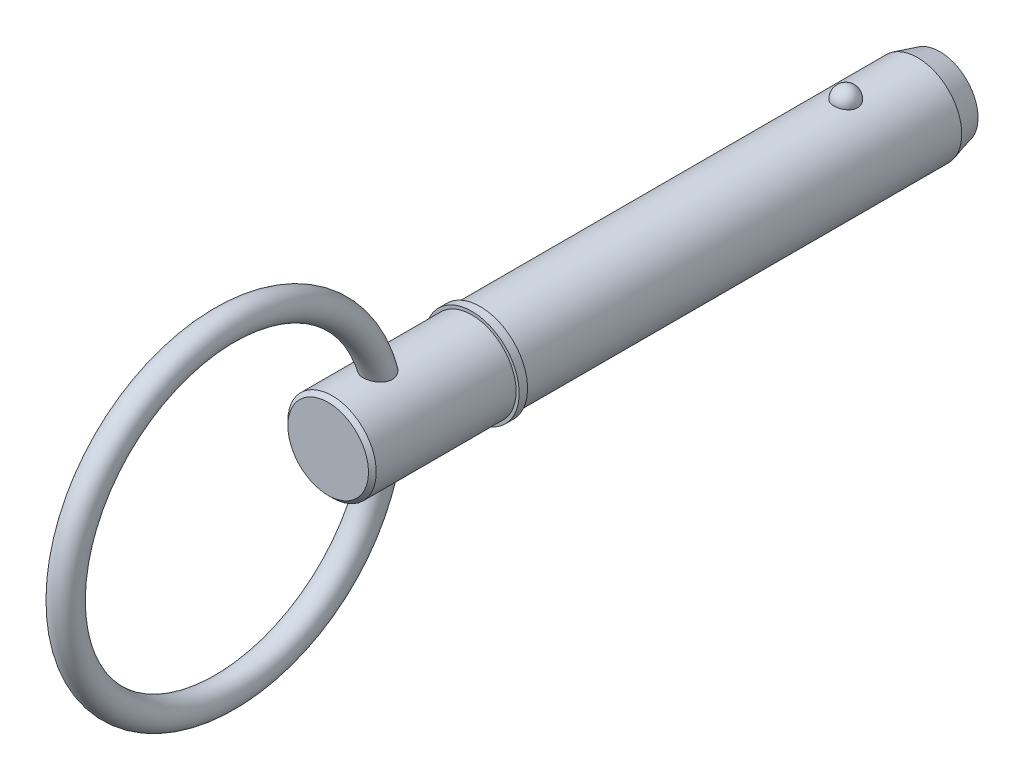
from build123d import *

# Parameters (mm, degrees)
SKETCH2_R           = 7.94
BOSS_EXTRUDE1_DEPTH = 63.5
BOSS_EXTRUDE2_START = 19.05
SKETCH3_R           = 7.94
BOSS_EXTRUDE2_DEPTH = 19.05
CHAMFER1_SIZE       = 4
CHAMFER1_SIZE2      = 1.07179677
SKETCH20_W          = 1.5
SKETCH20_H          = 8.5
SKETCH21_R          = 7.94
BOSS_EXTRUDE3_DEPTH = 27.31
CHAMFER2_SIZE       = 0.7
SKETCH24_R          = 2.5


with BuildPart() as part:
    # Sketch2 → Boss-Extrude1 (new body)
    with BuildSketch(Plane.XY):
        Circle(SKETCH2_R)
    extrude(amount=BOSS_EXTRUDE1_DEPTH)

    # Sketch3 → Boss-Extrude2 (add)
    with BuildSketch(Plane(origin=(0, 0, 0), x_dir=(-1, 0, 0), z_dir=(0, 0, -1)).offset(BOSS_EXTRUDE2_START)):
        Circle(SKETCH3_R)
    extrude(amount=-BOSS_EXTRUDE2_DEPTH)

    # Chamfer1
    chamfer1_edges = [part.edges().sort_by_distance(p)[0] for p in [
        (7.94, 0, -19.05),
    ]]
    chamfer1_side = [part.faces().sort_by_distance(p)[0] for p in [
        (7.94, 0, -9.525),
    ]]
    chamfer(chamfer1_edges, length=CHAMFER1_SIZE, length2=CHAMFER1_SIZE2, reference=chamfer1_side[0])

    # Sketch18 → Revolve1 (revolve)
    with BuildSketch(Plane(origin=(0, 0, 0), x_dir=(0, 0, -1), z_dir=(1, 0, 0))):
        with BuildLine():
            Line((2.15, 10.09), (2.15, 5.79))
            ThreePointArc((2.15, 5.79), (0, 7.94), (2.15, 10.09))
        make_face()
    revolve(axis=Axis((0, 10.09, -2.15), (0, -1, 0)))

    # Sketch20 → Revolve2 (revolve)
    with BuildSketch(Plane(origin=(0, 0, 0), x_dir=(0, 0, -1), z_dir=(1, 0, 0)), mode=Mode.PRIVATE) as revolve2_sk:
        with Locations((-64.25, 4.25)):
            Rectangle(SKETCH20_W, SKETCH20_H)
    revolve(revolve2_sk.sketch.rotate(Axis((0, 0, 33.728787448), (0, 0, 1)), 90), axis=Axis((0, 0, 33.728787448), (0, 0, 1)))

    # Sketch21 → Boss-Extrude3 (add)
    with BuildSketch(Plane(origin=(0, 0, 63.5), x_dir=(-1, 0, 0), z_dir=(0, 0, -1))):
        Circle(SKETCH21_R)
    extrude(amount=-BOSS_EXTRUDE3_DEPTH)

    # Chamfer2
    chamfer2_edges = [part.edges().sort_by_distance(p)[0] for p in [
        (7.94, 0, 90.81),
    ]]
    chamfer(chamfer2_edges, length=CHAMFER2_SIZE)

    # Sweep1: sweep along a path in Sketch23
    with BuildLine(Plane(origin=(0, 0, 0), x_dir=(0, 0, -1), z_dir=(1, 0, 0))) as sweep1_path:
        CenterArc((-109.385, 0), 28.575, 0, 360)
    # Sketch24 → Sweep1 (sweep)
    with BuildSketch(Plane(origin=(0, 0, 0), x_dir=(1, 0, 0), z_dir=(0, 1, 0))):
        with Locations((0, -80.81)):
            Circle(SKETCH24_R)
    sweep(path=sweep1_path.line)


solid = part.part
